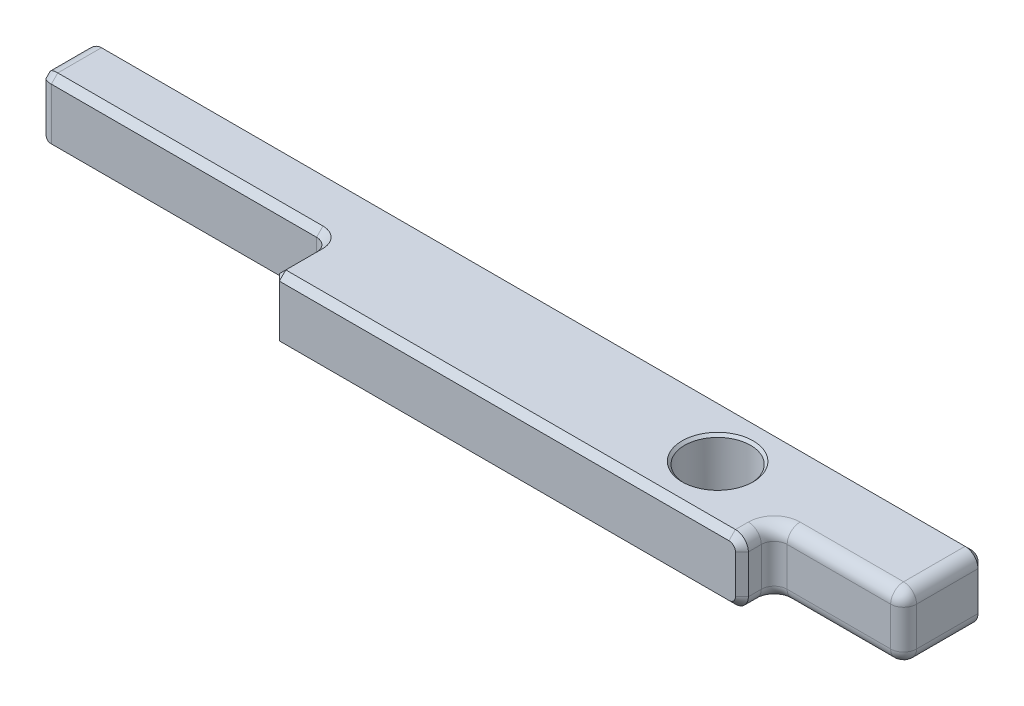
ISO-10303-21;
HEADER;
FILE_DESCRIPTION(('STEP AP214'),'2;1');
FILE_NAME('part.step','',(''),(''),'','','');
FILE_SCHEMA(('AUTOMOTIVE_DESIGN { 1 0 10303 214 1 1 1 1 }'));
ENDSEC;
DATA;
#1=APPLICATION_CONTEXT('core data for automotive mechanical design processes');
#2=APPLICATION_PROTOCOL_DEFINITION('international standard','automotive_design',2000,#1);
#3=PRODUCT_CONTEXT('',#1,'mechanical');
#4=PRODUCT('Part','Part','',(#3));
#5=PRODUCT_RELATED_PRODUCT_CATEGORY('part','',(#4));
#6=PRODUCT_DEFINITION_FORMATION('','',#4);
#7=PRODUCT_DEFINITION_CONTEXT('part definition',#1,'design');
#8=PRODUCT_DEFINITION('design','',#6,#7);
#9=PRODUCT_DEFINITION_SHAPE('','',#8);
#10=(LENGTH_UNIT() NAMED_UNIT(*) SI_UNIT(.MILLI.,.METRE.));
#11=(NAMED_UNIT(*) PLANE_ANGLE_UNIT() SI_UNIT($,.RADIAN.));
#12=(NAMED_UNIT(*) SI_UNIT($,.STERADIAN.) SOLID_ANGLE_UNIT());
#13=UNCERTAINTY_MEASURE_WITH_UNIT(LENGTH_MEASURE(1.E-05),#10,'distance_accuracy_value','');
#14=(GEOMETRIC_REPRESENTATION_CONTEXT(3) GLOBAL_UNCERTAINTY_ASSIGNED_CONTEXT((#13)) GLOBAL_UNIT_ASSIGNED_CONTEXT((#10,
#11,#12)) REPRESENTATION_CONTEXT('',''));
#15=CARTESIAN_POINT('',(0.,0.,0.));
#16=DIRECTION('',(0.,0.,1.));
#17=DIRECTION('',(1.,0.,0.));
#18=AXIS2_PLACEMENT_3D('',#15,#16,#17);
#19=CARTESIAN_POINT('',(41.275,-6.35,11.1125));
#20=DIRECTION('',(-1.,0.,0.));
#21=DIRECTION('',(0.,-1.,0.));
#22=AXIS2_PLACEMENT_3D('',#19,#20,#21);
#23=PLANE('',#22);
#24=DIRECTION('',(0.,0.,-1.));
#25=VECTOR('',#24,1.);
#26=CARTESIAN_POINT('',(41.275,-3.81,11.1125));
#27=LINE('',#26,#25);
#28=CARTESIAN_POINT('',(41.275,-3.81,2.2225));
#29=VERTEX_POINT('',#28);
#30=CARTESIAN_POINT('',(41.275,-3.81,-9.84250000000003));
#31=VERTEX_POINT('',#30);
#32=EDGE_CURVE('E330',#29,#31,#27,.T.);
#33=ORIENTED_EDGE('',*,*,#32,.T.);
#34=DIRECTION('',(0.,1.,0.));
#35=VECTOR('',#34,1.);
#36=CARTESIAN_POINT('',(41.275,3.81,-9.84250000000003));
#37=LINE('',#36,#35);
#38=CARTESIAN_POINT('',(41.275,3.81,-9.84250000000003));
#39=VERTEX_POINT('',#38);
#40=EDGE_CURVE('E833',#31,#39,#37,.T.);
#41=ORIENTED_EDGE('',*,*,#40,.T.);
#42=DIRECTION('',(0.,0.,-1.));
#43=VECTOR('',#42,1.);
#44=CARTESIAN_POINT('',(41.275,3.81,11.1125));
#45=LINE('',#44,#43);
#46=CARTESIAN_POINT('',(41.275,3.81,2.2225));
#47=VERTEX_POINT('',#46);
#48=EDGE_CURVE('E333',#39,#47,#45,.F.);
#49=ORIENTED_EDGE('',*,*,#48,.T.);
#50=DIRECTION('',(0.,1.,0.));
#51=VECTOR('',#50,1.);
#52=CARTESIAN_POINT('',(41.275,-6.35,2.2225));
#53=LINE('',#52,#51);
#54=EDGE_CURVE('E328',#47,#29,#53,.F.);
#55=ORIENTED_EDGE('',*,*,#54,.T.);
#56=EDGE_LOOP('',(#33,#41,#49,#55));
#57=FACE_BOUND('',#56,.T.);
#58=ADVANCED_FACE('F35',(#57),#23,.F.);
#59=CARTESIAN_POINT('',(-133.35,-6.35,11.1125));
#60=DIRECTION('',(1.,0.,0.));
#61=DIRECTION('',(0.,0.,-1.));
#62=AXIS2_PLACEMENT_3D('',#59,#60,#61);
#63=PLANE('',#62);
#64=DIRECTION('',(0.,0.,-1.));
#65=VECTOR('',#64,1.);
#66=CARTESIAN_POINT('',(-133.35,-3.81,11.1125));
#67=LINE('',#66,#65);
#68=CARTESIAN_POINT('',(-133.35,-3.81,-8.5725));
#69=VERTEX_POINT('',#68);
#70=CARTESIAN_POINT('',(-133.35,-3.81,-2.54));
#71=VERTEX_POINT('',#70);
#72=EDGE_CURVE('E271',#69,#71,#67,.F.);
#73=ORIENTED_EDGE('',*,*,#72,.T.);
#74=DIRECTION('',(0.,1.,0.));
#75=VECTOR('',#74,1.);
#76=CARTESIAN_POINT('',(-133.35,-6.35,-2.54));
#77=LINE('',#76,#75);
#78=CARTESIAN_POINT('',(-133.35,3.81,-2.54));
#79=VERTEX_POINT('',#78);
#80=EDGE_CURVE('E248',#71,#79,#77,.T.);
#81=ORIENTED_EDGE('',*,*,#80,.T.);
#82=DIRECTION('',(0.,0.,-1.));
#83=VECTOR('',#82,1.);
#84=CARTESIAN_POINT('',(-133.35,3.81,11.1125));
#85=LINE('',#84,#83);
#86=CARTESIAN_POINT('',(-133.35,3.81,-8.5725));
#87=VERTEX_POINT('',#86);
#88=EDGE_CURVE('E258',#79,#87,#85,.T.);
#89=ORIENTED_EDGE('',*,*,#88,.T.);
#90=DIRECTION('',(0.,-1.,0.));
#91=VECTOR('',#90,1.);
#92=CARTESIAN_POINT('',(-133.35,-6.35,-8.5725));
#93=LINE('',#92,#91);
#94=EDGE_CURVE('E265',#87,#69,#93,.T.);
#95=ORIENTED_EDGE('',*,*,#94,.T.);
#96=EDGE_LOOP('',(#73,#81,#89,#95));
#97=FACE_BOUND('',#96,.T.);
#98=ADVANCED_FACE('F269',(#97),#63,.F.);
#99=CARTESIAN_POINT('',(-133.35,-6.35,11.1125));
#100=DIRECTION('',(0.,1.,0.));
#101=DIRECTION('',(0.,0.,1.));
#102=AXIS2_PLACEMENT_3D('',#99,#100,#101);
#103=PLANE('',#102);
#104=CARTESIAN_POINT('',(0.,-6.35,0.));
#105=DIRECTION('',(0.,1.,0.));
#106=DIRECTION('',(0.,0.,1.));
#107=AXIS2_PLACEMENT_3D('',#104,#105,#106);
#108=CIRCLE('',#107,6.98500000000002);
#109=CARTESIAN_POINT('',(0.,-6.35,6.98500000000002));
#110=VERTEX_POINT('',#109);
#111=EDGE_CURVE('E382',#110,#110,#108,.T.);
#112=ORIENTED_EDGE('',*,*,#111,.T.);
#113=EDGE_LOOP('',(#112));
#114=FACE_BOUND('',#113,.T.);
#115=DIRECTION('',(0.,0.,-1.));
#116=VECTOR('',#115,1.);
#117=CARTESIAN_POINT('',(-130.81,-6.35,11.1125));
#118=LINE('',#117,#116);
#119=CARTESIAN_POINT('',(-130.81,-6.35,-1.26999999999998));
#120=VERTEX_POINT('',#119);
#121=CARTESIAN_POINT('',(-130.81,-6.35,-9.84250000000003));
#122=VERTEX_POINT('',#121);
#123=EDGE_CURVE('E887',#120,#122,#118,.T.);
#124=ORIENTED_EDGE('',*,*,#123,.T.);
#125=DIRECTION('',(1.,0.,0.));
#126=VECTOR('',#125,1.);
#127=CARTESIAN_POINT('',(38.735,-6.35,-9.84250000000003));
#128=LINE('',#127,#126);
#129=CARTESIAN_POINT('',(38.735,-6.35,-9.84250000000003));
#130=VERTEX_POINT('',#129);
#131=EDGE_CURVE('E419',#122,#130,#128,.T.);
#132=ORIENTED_EDGE('',*,*,#131,.T.);
#133=DIRECTION('',(0.,0.,-1.));
#134=VECTOR('',#133,1.);
#135=CARTESIAN_POINT('',(38.735,-6.35,11.1125));
#136=LINE('',#135,#134);
#137=CARTESIAN_POINT('',(38.735,-6.35,2.2225));
#138=VERTEX_POINT('',#137);
#139=EDGE_CURVE('E966',#130,#138,#136,.F.);
#140=ORIENTED_EDGE('',*,*,#139,.T.);
#141=DIRECTION('',(1.,0.,0.));
#142=VECTOR('',#141,1.);
#143=CARTESIAN_POINT('',(15.875,-6.35,2.2225));
#144=LINE('',#143,#142);
#145=CARTESIAN_POINT('',(18.415,-6.35,2.2225));
#146=VERTEX_POINT('',#145);
#147=EDGE_CURVE('E970',#138,#146,#144,.F.);
#148=ORIENTED_EDGE('',*,*,#147,.T.);
#149=CARTESIAN_POINT('',(18.415,-6.35,7.3025));
#150=DIRECTION('',(0.,1.,0.));
#151=DIRECTION('',(0.,0.,1.));
#152=AXIS2_PLACEMENT_3D('',#149,#150,#151);
#153=CIRCLE('',#152,5.08);
#154=CARTESIAN_POINT('',(13.335,-6.35,7.3025));
#155=VERTEX_POINT('',#154);
#156=EDGE_CURVE('E401',#155,#146,#153,.F.);
#157=ORIENTED_EDGE('',*,*,#156,.F.);
#158=DIRECTION('',(0.,0.,1.));
#159=VECTOR('',#158,1.);
#160=CARTESIAN_POINT('',(13.335,-6.35,11.1125));
#161=LINE('',#160,#159);
#162=CARTESIAN_POINT('',(13.335,-6.35,9.84250000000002));
#163=VERTEX_POINT('',#162);
#164=EDGE_CURVE('E891',#155,#163,#161,.T.);
#165=ORIENTED_EDGE('',*,*,#164,.T.);
#166=DIRECTION('',(-1.,0.,0.));
#167=VECTOR('',#166,1.);
#168=CARTESIAN_POINT('',(-133.35,-6.35,9.84250000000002));
#169=LINE('',#168,#167);
#170=CARTESIAN_POINT('',(-74.93,-6.35,9.84250000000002));
#171=VERTEX_POINT('',#170);
#172=EDGE_CURVE('E818',#163,#171,#169,.T.);
#173=ORIENTED_EDGE('',*,*,#172,.T.);
#174=DIRECTION('',(0.,0.,-1.));
#175=VECTOR('',#174,1.);
#176=CARTESIAN_POINT('',(-74.93,-6.35,11.1125));
#177=LINE('',#176,#175);
#178=CARTESIAN_POINT('',(-74.93,-6.35,2.54));
#179=VERTEX_POINT('',#178);
#180=EDGE_CURVE('E821',#171,#179,#177,.T.);
#181=ORIENTED_EDGE('',*,*,#180,.T.);
#182=CARTESIAN_POINT('',(-78.74,-6.35,2.54));
#183=DIRECTION('',(0.,1.,0.));
#184=DIRECTION('',(0.,0.,1.));
#185=AXIS2_PLACEMENT_3D('',#182,#183,#184);
#186=CIRCLE('',#185,3.80999999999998);
#187=CARTESIAN_POINT('',(-78.74,-6.35,-1.26999999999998));
#188=VERTEX_POINT('',#187);
#189=EDGE_CURVE('E823',#179,#188,#186,.T.);
#190=ORIENTED_EDGE('',*,*,#189,.T.);
#191=DIRECTION('',(-1.,0.,0.));
#192=VECTOR('',#191,1.);
#193=CARTESIAN_POINT('',(-133.35,-6.35,-1.26999999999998));
#194=LINE('',#193,#192);
#195=EDGE_CURVE('E827',#188,#120,#194,.T.);
#196=ORIENTED_EDGE('',*,*,#195,.T.);
#197=EDGE_LOOP('',(#124,#132,#140,#148,#157,#165,#173,#181,#190,#196));
#198=FACE_BOUND('',#197,.T.);
#199=ADVANCED_FACE('F740',(#114,#198),#103,.F.);
#200=CARTESIAN_POINT('',(-133.35,6.35,11.1125));
#201=DIRECTION('',(0.,-1.,0.));
#202=DIRECTION('',(0.,0.,-1.));
#203=AXIS2_PLACEMENT_3D('',#200,#201,#202);
#204=PLANE('',#203);
#205=DIRECTION('',(0.,0.,-1.));
#206=VECTOR('',#205,1.);
#207=CARTESIAN_POINT('',(38.735,6.35,11.1125));
#208=LINE('',#207,#206);
#209=CARTESIAN_POINT('',(38.735,6.35,2.2225));
#210=VERTEX_POINT('',#209);
#211=CARTESIAN_POINT('',(38.735,6.35,-9.84250000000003));
#212=VERTEX_POINT('',#211);
#213=EDGE_CURVE('E984',#210,#212,#208,.T.);
#214=ORIENTED_EDGE('',*,*,#213,.T.);
#215=DIRECTION('',(-1.,0.,0.));
#216=VECTOR('',#215,1.);
#217=CARTESIAN_POINT('',(-130.81,6.35,-9.84250000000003));
#218=LINE('',#217,#216);
#219=CARTESIAN_POINT('',(-130.81,6.35,-9.84250000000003));
#220=VERTEX_POINT('',#219);
#221=EDGE_CURVE('E851',#212,#220,#218,.T.);
#222=ORIENTED_EDGE('',*,*,#221,.T.);
#223=DIRECTION('',(0.,0.,-1.));
#224=VECTOR('',#223,1.);
#225=CARTESIAN_POINT('',(-130.81,6.35,11.1125));
#226=LINE('',#225,#224);
#227=CARTESIAN_POINT('',(-130.81,6.35,-1.26999999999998));
#228=VERTEX_POINT('',#227);
#229=EDGE_CURVE('E311',#220,#228,#226,.F.);
#230=ORIENTED_EDGE('',*,*,#229,.T.);
#231=DIRECTION('',(1.,0.,0.));
#232=VECTOR('',#231,1.);
#233=CARTESIAN_POINT('',(-133.35,6.35,-1.26999999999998));
#234=LINE('',#233,#232);
#235=CARTESIAN_POINT('',(-78.74,6.35,-1.26999999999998));
#236=VERTEX_POINT('',#235);
#237=EDGE_CURVE('E857',#228,#236,#234,.T.);
#238=ORIENTED_EDGE('',*,*,#237,.T.);
#239=CARTESIAN_POINT('',(-78.74,6.35,2.54));
#240=DIRECTION('',(0.,-1.,0.));
#241=DIRECTION('',(0.,0.,-1.));
#242=AXIS2_PLACEMENT_3D('',#239,#240,#241);
#243=CIRCLE('',#242,3.80999999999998);
#244=CARTESIAN_POINT('',(-74.93,6.35,2.54));
#245=VERTEX_POINT('',#244);
#246=EDGE_CURVE('E861',#236,#245,#243,.T.);
#247=ORIENTED_EDGE('',*,*,#246,.T.);
#248=DIRECTION('',(0.,0.,1.));
#249=VECTOR('',#248,1.);
#250=CARTESIAN_POINT('',(-74.93,6.35,11.1125));
#251=LINE('',#250,#249);
#252=CARTESIAN_POINT('',(-74.93,6.35,9.84250000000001));
#253=VERTEX_POINT('',#252);
#254=EDGE_CURVE('E863',#245,#253,#251,.T.);
#255=ORIENTED_EDGE('',*,*,#254,.T.);
#256=DIRECTION('',(1.,0.,0.));
#257=VECTOR('',#256,1.);
#258=CARTESIAN_POINT('',(-133.35,6.35,9.84250000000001));
#259=LINE('',#258,#257);
#260=CARTESIAN_POINT('',(13.335,6.35,9.84250000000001));
#261=VERTEX_POINT('',#260);
#262=EDGE_CURVE('E855',#253,#261,#259,.T.);
#263=ORIENTED_EDGE('',*,*,#262,.T.);
#264=DIRECTION('',(0.,0.,-1.));
#265=VECTOR('',#264,1.);
#266=CARTESIAN_POINT('',(13.335,6.35,11.1125));
#267=LINE('',#266,#265);
#268=CARTESIAN_POINT('',(13.335,6.35,7.3025));
#269=VERTEX_POINT('',#268);
#270=EDGE_CURVE('E315',#261,#269,#267,.T.);
#271=ORIENTED_EDGE('',*,*,#270,.T.);
#272=CARTESIAN_POINT('',(18.415,6.35,7.3025));
#273=DIRECTION('',(0.,-1.,0.));
#274=DIRECTION('',(0.,0.,-1.));
#275=AXIS2_PLACEMENT_3D('',#272,#273,#274);
#276=CIRCLE('',#275,5.08);
#277=CARTESIAN_POINT('',(18.415,6.35,2.2225));
#278=VERTEX_POINT('',#277);
#279=EDGE_CURVE('E1331',#278,#269,#276,.F.);
#280=ORIENTED_EDGE('',*,*,#279,.F.);
#281=DIRECTION('',(-1.,0.,0.));
#282=VECTOR('',#281,1.);
#283=CARTESIAN_POINT('',(41.275,6.35,2.2225));
#284=LINE('',#283,#282);
#285=EDGE_CURVE('E901',#278,#210,#284,.F.);
#286=ORIENTED_EDGE('',*,*,#285,.T.);
#287=EDGE_LOOP('',(#214,#222,#230,#238,#247,#255,#263,#271,#280,#286));
#288=FACE_BOUND('',#287,.T.);
#289=CARTESIAN_POINT('',(0.,6.35,0.));
#290=DIRECTION('',(0.,-1.,0.));
#291=DIRECTION('',(0.,0.,-1.));
#292=AXIS2_PLACEMENT_3D('',#289,#290,#291);
#293=CIRCLE('',#292,6.98500000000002);
#294=CARTESIAN_POINT('',(0.,6.35,-6.98500000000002));
#295=VERTEX_POINT('',#294);
#296=EDGE_CURVE('E266',#295,#295,#293,.T.);
#297=ORIENTED_EDGE('',*,*,#296,.T.);
#298=EDGE_LOOP('',(#297));
#299=FACE_BOUND('',#298,.T.);
#300=ADVANCED_FACE('F744',(#288,#299),#204,.F.);
#301=CARTESIAN_POINT('',(-133.35,6.35,11.1125));
#302=DIRECTION('',(0.,0.,-1.));
#303=DIRECTION('',(-1.,0.,0.));
#304=AXIS2_PLACEMENT_3D('',#301,#302,#303);
#305=PLANE('',#304);
#306=DIRECTION('',(0.,1.,0.));
#307=VECTOR('',#306,1.);
#308=CARTESIAN_POINT('',(14.605,6.35000000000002,11.1125));
#309=LINE('',#308,#307);
#310=CARTESIAN_POINT('',(14.605,-3.81,11.1125));
#311=VERTEX_POINT('',#310);
#312=CARTESIAN_POINT('',(14.605,3.81,11.1125));
#313=VERTEX_POINT('',#312);
#314=EDGE_CURVE('E789',#311,#313,#309,.T.);
#315=ORIENTED_EDGE('',*,*,#314,.T.);
#316=CARTESIAN_POINT('',(13.335,3.81,11.1125));
#317=DIRECTION('',(0.,0.,-1.));
#318=DIRECTION('',(-1.,0.,0.));
#319=AXIS2_PLACEMENT_3D('',#316,#317,#318);
#320=CIRCLE('',#319,1.27000000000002);
#321=CARTESIAN_POINT('',(13.335,5.08000000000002,11.1125));
#322=VERTEX_POINT('',#321);
#323=EDGE_CURVE('E792',#313,#322,#320,.F.);
#324=ORIENTED_EDGE('',*,*,#323,.T.);
#325=DIRECTION('',(-1.,0.,0.));
#326=VECTOR('',#325,1.);
#327=CARTESIAN_POINT('',(-133.35,5.08000000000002,11.1125));
#328=LINE('',#327,#326);
#329=CARTESIAN_POINT('',(-74.93,5.08000000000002,11.1125));
#330=VERTEX_POINT('',#329);
#331=EDGE_CURVE('E1340',#322,#330,#328,.T.);
#332=ORIENTED_EDGE('',*,*,#331,.T.);
#333=DIRECTION('',(0.,-1.,0.));
#334=VECTOR('',#333,1.);
#335=CARTESIAN_POINT('',(-74.93,6.35,11.1125));
#336=LINE('',#335,#334);
#337=CARTESIAN_POINT('',(-74.93,-5.08000000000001,11.1125));
#338=VERTEX_POINT('',#337);
#339=EDGE_CURVE('E252',#330,#338,#336,.T.);
#340=ORIENTED_EDGE('',*,*,#339,.T.);
#341=DIRECTION('',(1.,0.,0.));
#342=VECTOR('',#341,1.);
#343=CARTESIAN_POINT('',(-133.35,-5.08000000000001,11.1125));
#344=LINE('',#343,#342);
#345=CARTESIAN_POINT('',(13.335,-5.08000000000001,11.1125));
#346=VERTEX_POINT('',#345);
#347=EDGE_CURVE('E1342',#338,#346,#344,.T.);
#348=ORIENTED_EDGE('',*,*,#347,.T.);
#349=CARTESIAN_POINT('',(13.335,-3.81,11.1125));
#350=DIRECTION('',(0.,0.,-1.));
#351=DIRECTION('',(-1.,0.,0.));
#352=AXIS2_PLACEMENT_3D('',#349,#350,#351);
#353=CIRCLE('',#352,1.27000000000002);
#354=EDGE_CURVE('E794',#346,#311,#353,.F.);
#355=ORIENTED_EDGE('',*,*,#354,.T.);
#356=EDGE_LOOP('',(#315,#324,#332,#340,#348,#355));
#357=FACE_BOUND('',#356,.T.);
#358=ADVANCED_FACE('F777',(#357),#305,.F.);
#359=CARTESIAN_POINT('',(-133.35,6.35,-11.1125));
#360=DIRECTION('',(0.,0.,-1.));
#361=DIRECTION('',(-1.,0.,0.));
#362=AXIS2_PLACEMENT_3D('',#359,#360,#361);
#363=PLANE('',#362);
#364=DIRECTION('',(0.,-1.,0.));
#365=VECTOR('',#364,1.);
#366=CARTESIAN_POINT('',(-130.81,6.35,-11.1125));
#367=LINE('',#366,#365);
#368=CARTESIAN_POINT('',(-130.81,-5.08000000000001,-11.1125));
#369=VERTEX_POINT('',#368);
#370=CARTESIAN_POINT('',(-130.81,5.08000000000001,-11.1125));
#371=VERTEX_POINT('',#370);
#372=EDGE_CURVE('E890',#369,#371,#367,.F.);
#373=ORIENTED_EDGE('',*,*,#372,.T.);
#374=DIRECTION('',(1.,0.,0.));
#375=VECTOR('',#374,1.);
#376=CARTESIAN_POINT('',(38.735,5.08000000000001,-11.1125));
#377=LINE('',#376,#375);
#378=CARTESIAN_POINT('',(38.735,5.08000000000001,-11.1125));
#379=VERTEX_POINT('',#378);
#380=EDGE_CURVE('E837',#371,#379,#377,.T.);
#381=ORIENTED_EDGE('',*,*,#380,.T.);
#382=CARTESIAN_POINT('',(38.735,3.81,-11.1125));
#383=DIRECTION('',(0.,0.,-1.));
#384=DIRECTION('',(-1.,0.,0.));
#385=AXIS2_PLACEMENT_3D('',#382,#383,#384);
#386=CIRCLE('',#385,1.27000000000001);
#387=CARTESIAN_POINT('',(40.005,3.81,-11.1125));
#388=VERTEX_POINT('',#387);
#389=EDGE_CURVE('E841',#379,#388,#386,.T.);
#390=ORIENTED_EDGE('',*,*,#389,.T.);
#391=DIRECTION('',(0.,-1.,0.));
#392=VECTOR('',#391,1.);
#393=CARTESIAN_POINT('',(40.005,-3.81,-11.1125));
#394=LINE('',#393,#392);
#395=CARTESIAN_POINT('',(40.005,-3.81,-11.1125));
#396=VERTEX_POINT('',#395);
#397=EDGE_CURVE('E843',#388,#396,#394,.T.);
#398=ORIENTED_EDGE('',*,*,#397,.T.);
#399=CARTESIAN_POINT('',(38.735,-3.81,-11.1125));
#400=DIRECTION('',(0.,0.,-1.));
#401=DIRECTION('',(-1.,0.,0.));
#402=AXIS2_PLACEMENT_3D('',#399,#400,#401);
#403=CIRCLE('',#402,1.27000000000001);
#404=CARTESIAN_POINT('',(38.735,-5.08000000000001,-11.1125));
#405=VERTEX_POINT('',#404);
#406=EDGE_CURVE('E845',#396,#405,#403,.T.);
#407=ORIENTED_EDGE('',*,*,#406,.T.);
#408=DIRECTION('',(-1.,0.,0.));
#409=VECTOR('',#408,1.);
#410=CARTESIAN_POINT('',(-130.81,-5.08000000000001,-11.1125));
#411=LINE('',#410,#409);
#412=EDGE_CURVE('E847',#405,#369,#411,.T.);
#413=ORIENTED_EDGE('',*,*,#412,.T.);
#414=EDGE_LOOP('',(#373,#381,#390,#398,#407,#413));
#415=FACE_BOUND('',#414,.T.);
#416=ADVANCED_FACE('F767',(#415),#363,.T.);
#417=CARTESIAN_POINT('',(0.,-6.35,0.));
#418=DIRECTION('',(0.,1.,0.));
#419=DIRECTION('',(0.,0.,1.));
#420=AXIS2_PLACEMENT_3D('',#417,#418,#419);
#421=CYLINDRICAL_SURFACE('',#420,6.477);
#422=CARTESIAN_POINT('',(0.,-5.842,0.));
#423=DIRECTION('',(0.,1.,0.));
#424=DIRECTION('',(0.,0.,1.));
#425=AXIS2_PLACEMENT_3D('',#422,#423,#424);
#426=CIRCLE('',#425,6.477);
#427=CARTESIAN_POINT('',(0.,-5.842,6.477));
#428=VERTEX_POINT('',#427);
#429=EDGE_CURVE('E392',#428,#428,#426,.F.);
#430=ORIENTED_EDGE('',*,*,#429,.T.);
#431=EDGE_LOOP('',(#430));
#432=FACE_BOUND('',#431,.T.);
#433=CARTESIAN_POINT('',(0.,5.842,0.));
#434=DIRECTION('',(0.,-1.,0.));
#435=DIRECTION('',(0.,0.,-1.));
#436=AXIS2_PLACEMENT_3D('',#433,#434,#435);
#437=CIRCLE('',#436,6.477);
#438=CARTESIAN_POINT('',(0.,5.842,-6.477));
#439=VERTEX_POINT('',#438);
#440=EDGE_CURVE('E387',#439,#439,#437,.F.);
#441=ORIENTED_EDGE('',*,*,#440,.T.);
#442=EDGE_LOOP('',(#441));
#443=FACE_BOUND('',#442,.T.);
#444=ADVANCED_FACE('F764',(#432,#443),#421,.F.);
#445=CARTESIAN_POINT('',(15.875,-14.3521023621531,4.7625));
#446=DIRECTION('',(0.,0.,1.));
#447=DIRECTION('',(1.,0.,0.));
#448=AXIS2_PLACEMENT_3D('',#445,#446,#447);
#449=PLANE('',#448);
#450=DIRECTION('',(1.,0.,0.));
#451=VECTOR('',#450,1.);
#452=CARTESIAN_POINT('',(41.275,-3.81,4.7625));
#453=LINE('',#452,#451);
#454=CARTESIAN_POINT('',(18.415,-3.81,4.7625));
#455=VERTEX_POINT('',#454);
#456=CARTESIAN_POINT('',(38.735,-3.81,4.7625));
#457=VERTEX_POINT('',#456);
#458=EDGE_CURVE('E337',#455,#457,#453,.T.);
#459=ORIENTED_EDGE('',*,*,#458,.T.);
#460=DIRECTION('',(0.,1.,0.));
#461=VECTOR('',#460,1.);
#462=CARTESIAN_POINT('',(38.735,6.35,4.7625));
#463=LINE('',#462,#461);
#464=CARTESIAN_POINT('',(38.735,3.81,4.7625));
#465=VERTEX_POINT('',#464);
#466=EDGE_CURVE('E341',#457,#465,#463,.T.);
#467=ORIENTED_EDGE('',*,*,#466,.T.);
#468=DIRECTION('',(-1.,0.,0.));
#469=VECTOR('',#468,1.);
#470=CARTESIAN_POINT('',(15.875,3.81,4.7625));
#471=LINE('',#470,#469);
#472=CARTESIAN_POINT('',(18.415,3.81,4.7625));
#473=VERTEX_POINT('',#472);
#474=EDGE_CURVE('E339',#465,#473,#471,.T.);
#475=ORIENTED_EDGE('',*,*,#474,.T.);
#476=DIRECTION('',(0.,-1.,0.));
#477=VECTOR('',#476,1.);
#478=CARTESIAN_POINT('',(18.415,-14.3521023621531,4.7625));
#479=LINE('',#478,#477);
#480=EDGE_CURVE('E335',#473,#455,#479,.T.);
#481=ORIENTED_EDGE('',*,*,#480,.T.);
#482=EDGE_LOOP('',(#459,#467,#475,#481));
#483=FACE_BOUND('',#482,.T.);
#484=ADVANCED_FACE('F766',(#483),#449,.T.);
#485=CARTESIAN_POINT('',(15.875,14.517153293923,4.7625));
#486=DIRECTION('',(-1.,0.,0.));
#487=DIRECTION('',(0.,-1.,0.));
#488=AXIS2_PLACEMENT_3D('',#485,#486,#487);
#489=PLANE('',#488);
#490=DIRECTION('',(0.,0.,-1.));
#491=VECTOR('',#490,1.);
#492=CARTESIAN_POINT('',(15.875,3.81,4.7625));
#493=LINE('',#492,#491);
#494=CARTESIAN_POINT('',(15.875,3.81,7.3025));
#495=VERTEX_POINT('',#494);
#496=CARTESIAN_POINT('',(15.875,3.81,9.84250000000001));
#497=VERTEX_POINT('',#496);
#498=EDGE_CURVE('E325',#495,#497,#493,.F.);
#499=ORIENTED_EDGE('',*,*,#498,.T.);
#500=DIRECTION('',(0.,-1.,0.));
#501=VECTOR('',#500,1.);
#502=CARTESIAN_POINT('',(15.875,14.517153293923,9.84250000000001));
#503=LINE('',#502,#501);
#504=CARTESIAN_POINT('',(15.875,-3.81,9.84250000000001));
#505=VERTEX_POINT('',#504);
#506=EDGE_CURVE('E446',#497,#505,#503,.T.);
#507=ORIENTED_EDGE('',*,*,#506,.T.);
#508=DIRECTION('',(0.,0.,1.));
#509=VECTOR('',#508,1.);
#510=CARTESIAN_POINT('',(15.875,-3.81,4.7625));
#511=LINE('',#510,#509);
#512=CARTESIAN_POINT('',(15.875,-3.81,7.3025));
#513=VERTEX_POINT('',#512);
#514=EDGE_CURVE('E323',#505,#513,#511,.F.);
#515=ORIENTED_EDGE('',*,*,#514,.T.);
#516=DIRECTION('',(0.,-1.,0.));
#517=VECTOR('',#516,1.);
#518=CARTESIAN_POINT('',(15.875,14.517153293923,7.3025));
#519=LINE('',#518,#517);
#520=EDGE_CURVE('E314',#513,#495,#519,.F.);
#521=ORIENTED_EDGE('',*,*,#520,.T.);
#522=EDGE_LOOP('',(#499,#507,#515,#521));
#523=FACE_BOUND('',#522,.T.);
#524=ADVANCED_FACE('F774',(#523),#489,.F.);
#525=CARTESIAN_POINT('',(-152.4,12.7,0.));
#526=DIRECTION('',(0.,0.,-1.));
#527=DIRECTION('',(-1.,0.,0.));
#528=AXIS2_PLACEMENT_3D('',#525,#526,#527);
#529=PLANE('',#528);
#530=DIRECTION('',(0.,1.,0.));
#531=VECTOR('',#530,1.);
#532=CARTESIAN_POINT('',(-78.74,6.35,0.));
#533=LINE('',#532,#531);
#534=CARTESIAN_POINT('',(-78.74,-5.08,0.));
#535=VERTEX_POINT('',#534);
#536=CARTESIAN_POINT('',(-78.74,5.08000000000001,0.));
#537=VERTEX_POINT('',#536);
#538=EDGE_CURVE('E272',#535,#537,#533,.T.);
#539=ORIENTED_EDGE('',*,*,#538,.T.);
#540=DIRECTION('',(-1.,0.,0.));
#541=VECTOR('',#540,1.);
#542=CARTESIAN_POINT('',(-152.4,5.08000000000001,0.));
#543=LINE('',#542,#541);
#544=CARTESIAN_POINT('',(-130.81,5.08000000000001,0.));
#545=VERTEX_POINT('',#544);
#546=EDGE_CURVE('E426',#537,#545,#543,.T.);
#547=ORIENTED_EDGE('',*,*,#546,.T.);
#548=DIRECTION('',(0.,1.,0.));
#549=VECTOR('',#548,1.);
#550=CARTESIAN_POINT('',(-130.81,12.7,0.));
#551=LINE('',#550,#549);
#552=CARTESIAN_POINT('',(-130.81,-5.08,0.));
#553=VERTEX_POINT('',#552);
#554=EDGE_CURVE('E251',#545,#553,#551,.F.);
#555=ORIENTED_EDGE('',*,*,#554,.T.);
#556=DIRECTION('',(1.,0.,0.));
#557=VECTOR('',#556,1.);
#558=CARTESIAN_POINT('',(-152.4,-5.08,0.));
#559=LINE('',#558,#557);
#560=EDGE_CURVE('E423',#553,#535,#559,.T.);
#561=ORIENTED_EDGE('',*,*,#560,.T.);
#562=EDGE_LOOP('',(#539,#547,#555,#561));
#563=FACE_BOUND('',#562,.T.);
#564=ADVANCED_FACE('F421',(#563),#529,.F.);
#565=CARTESIAN_POINT('',(-76.2,-12.7,0.));
#566=DIRECTION('',(1.,0.,0.));
#567=DIRECTION('',(0.,0.,-1.));
#568=AXIS2_PLACEMENT_3D('',#565,#566,#567);
#569=PLANE('',#568);
#570=DIRECTION('',(0.,1.,0.));
#571=VECTOR('',#570,1.);
#572=CARTESIAN_POINT('',(-76.2,-12.7,9.84250000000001));
#573=LINE('',#572,#571);
#574=CARTESIAN_POINT('',(-76.2,-5.08000000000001,9.84250000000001));
#575=VERTEX_POINT('',#574);
#576=CARTESIAN_POINT('',(-76.2,5.08,9.84250000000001));
#577=VERTEX_POINT('',#576);
#578=EDGE_CURVE('E48',#575,#577,#573,.T.);
#579=ORIENTED_EDGE('',*,*,#578,.T.);
#580=DIRECTION('',(0.,0.,-1.));
#581=VECTOR('',#580,1.);
#582=CARTESIAN_POINT('',(-76.2,5.08,0.));
#583=LINE('',#582,#581);
#584=CARTESIAN_POINT('',(-76.2,5.08,2.54));
#585=VERTEX_POINT('',#584);
#586=EDGE_CURVE('E11',#577,#585,#583,.T.);
#587=ORIENTED_EDGE('',*,*,#586,.T.);
#588=DIRECTION('',(0.,1.,0.));
#589=VECTOR('',#588,1.);
#590=CARTESIAN_POINT('',(-76.2,-6.35,2.54));
#591=LINE('',#590,#589);
#592=CARTESIAN_POINT('',(-76.2,-5.08,2.54));
#593=VERTEX_POINT('',#592);
#594=EDGE_CURVE('E239',#585,#593,#591,.F.);
#595=ORIENTED_EDGE('',*,*,#594,.T.);
#596=DIRECTION('',(0.,0.,1.));
#597=VECTOR('',#596,1.);
#598=CARTESIAN_POINT('',(-76.2,-5.08000000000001,0.));
#599=LINE('',#598,#597);
#600=EDGE_CURVE('E59',#593,#575,#599,.T.);
#601=ORIENTED_EDGE('',*,*,#600,.T.);
#602=EDGE_LOOP('',(#579,#587,#595,#601));
#603=FACE_BOUND('',#602,.T.);
#604=ADVANCED_FACE('F751',(#603),#569,.F.);
#605=CARTESIAN_POINT('',(0.,-6.35,0.));
#606=DIRECTION('',(0.,-1.,0.));
#607=DIRECTION('',(0.,0.,-1.));
#608=AXIS2_PLACEMENT_3D('',#605,#606,#607);
#609=CONICAL_SURFACE('',#608,6.98500000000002,0.78539816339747);
#610=ORIENTED_EDGE('',*,*,#429,.F.);
#611=EDGE_LOOP('',(#610));
#612=FACE_BOUND('',#611,.T.);
#613=ORIENTED_EDGE('',*,*,#111,.F.);
#614=EDGE_LOOP('',(#613));
#615=FACE_BOUND('',#614,.T.);
#616=ADVANCED_FACE('F748',(#612,#615),#609,.F.);
#617=CARTESIAN_POINT('',(0.,5.842,0.));
#618=DIRECTION('',(0.,1.,0.));
#619=DIRECTION('',(0.,0.,1.));
#620=AXIS2_PLACEMENT_3D('',#617,#618,#619);
#621=CONICAL_SURFACE('',#620,6.477,0.785398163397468);
#622=ORIENTED_EDGE('',*,*,#296,.F.);
#623=EDGE_LOOP('',(#622));
#624=FACE_BOUND('',#623,.T.);
#625=ORIENTED_EDGE('',*,*,#440,.F.);
#626=EDGE_LOOP('',(#625));
#627=FACE_BOUND('',#626,.T.);
#628=ADVANCED_FACE('F750',(#624,#627),#621,.F.);
#629=CARTESIAN_POINT('',(-130.81,-6.35,-8.5725));
#630=DIRECTION('',(0.,1.,0.));
#631=DIRECTION('',(0.,0.,1.));
#632=AXIS2_PLACEMENT_3D('',#629,#630,#631);
#633=CYLINDRICAL_SURFACE('',#632,2.54);
#634=ORIENTED_EDGE('',*,*,#94,.F.);
#635=CARTESIAN_POINT('',(-130.81,5.08000000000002,-11.1125));
#636=CARTESIAN_POINT('',(-132.167238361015,5.09753017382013,-11.1475603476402));
#637=CARTESIAN_POINT('',(-133.38506034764,4.48861918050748,-9.92973836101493));
#638=CARTESIAN_POINT('',(-133.35,3.81,-8.5725));
#639=B_SPLINE_CURVE_WITH_KNOTS('',3,(#635,#636,#637,#638),.UNSPECIFIED.,.F.,.F.,(4,4),
(-1.5707963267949,0.),.UNSPECIFIED.);
#640=EDGE_CURVE('E525',#87,#371,#639,.F.);
#641=ORIENTED_EDGE('',*,*,#640,.T.);
#642=ORIENTED_EDGE('',*,*,#372,.F.);
#643=CARTESIAN_POINT('',(-133.35,-3.81,-8.5725));
#644=CARTESIAN_POINT('',(-133.38506034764,-4.48861918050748,-9.92973836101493));
#645=CARTESIAN_POINT('',(-132.167238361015,-5.09753017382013,-11.1475603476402));
#646=CARTESIAN_POINT('',(-130.81,-5.08000000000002,-11.1125));
#647=B_SPLINE_CURVE_WITH_KNOTS('',3,(#643,#644,#645,#646),.UNSPECIFIED.,.F.,.F.,(4,4),(0.,
1.5707963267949),.UNSPECIFIED.);
#648=EDGE_CURVE('E590',#369,#69,#647,.F.);
#649=ORIENTED_EDGE('',*,*,#648,.T.);
#650=EDGE_LOOP('',(#634,#641,#642,#649));
#651=FACE_BOUND('',#650,.T.);
#652=ADVANCED_FACE('F754',(#651),#633,.T.);
#653=CARTESIAN_POINT('',(-130.81,-3.81,11.1125));
#654=DIRECTION('',(0.,0.,-1.));
#655=DIRECTION('',(-1.,0.,0.));
#656=AXIS2_PLACEMENT_3D('',#653,#654,#655);
#657=CYLINDRICAL_SURFACE('',#656,2.54);
#658=ORIENTED_EDGE('',*,*,#72,.F.);
#659=CARTESIAN_POINT('',(-130.81,-6.35000000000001,-9.84250000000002));
#660=CARTESIAN_POINT('',(-132.167238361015,-6.38506034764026,-9.86003017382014));
#661=CARTESIAN_POINT('',(-133.38506034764,-5.16723836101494,-9.25111918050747));
#662=CARTESIAN_POINT('',(-133.35,-3.81,-8.5725));
#663=B_SPLINE_CURVE_WITH_KNOTS('',3,(#659,#660,#661,#662),.UNSPECIFIED.,.F.,.F.,(4,4),(0.,
1.5707963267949),.UNSPECIFIED.);
#664=EDGE_CURVE('E865',#69,#122,#663,.F.);
#665=ORIENTED_EDGE('',*,*,#664,.T.);
#666=ORIENTED_EDGE('',*,*,#123,.F.);
#667=CARTESIAN_POINT('',(-133.35,-3.81,-2.54));
#668=CARTESIAN_POINT('',(-133.38506034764,-5.16723836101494,-1.86138081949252));
#669=CARTESIAN_POINT('',(-132.167238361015,-6.38506034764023,-1.25246982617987));
#670=CARTESIAN_POINT('',(-130.81,-6.35000000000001,-1.26999999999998));
#671=B_SPLINE_CURVE_WITH_KNOTS('',3,(#667,#668,#669,#670),.UNSPECIFIED.,.F.,.F.,(4,4),
(1.5707963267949,3.14159265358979),.UNSPECIFIED.);
#672=EDGE_CURVE('E430',#120,#71,#671,.F.);
#673=ORIENTED_EDGE('',*,*,#672,.T.);
#674=EDGE_LOOP('',(#658,#665,#666,#673));
#675=FACE_BOUND('',#674,.T.);
#676=ADVANCED_FACE('F296',(#675),#657,.T.);
#677=CARTESIAN_POINT('',(-130.81,3.81,11.1125));
#678=DIRECTION('',(0.,0.,-1.));
#679=DIRECTION('',(-1.,0.,0.));
#680=AXIS2_PLACEMENT_3D('',#677,#678,#679);
#681=CYLINDRICAL_SURFACE('',#680,2.54);
#682=ORIENTED_EDGE('',*,*,#229,.F.);
#683=CARTESIAN_POINT('',(-133.35,3.81,-8.5725));
#684=CARTESIAN_POINT('',(-133.38506034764,5.16723836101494,-9.25111918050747));
#685=CARTESIAN_POINT('',(-132.167238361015,6.38506034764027,-9.86003017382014));
#686=CARTESIAN_POINT('',(-130.81,6.35000000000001,-9.84250000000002));
#687=B_SPLINE_CURVE_WITH_KNOTS('',3,(#683,#684,#685,#686),.UNSPECIFIED.,.F.,.F.,(4,4),
(-1.5707963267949,0.),.UNSPECIFIED.);
#688=EDGE_CURVE('E238',#220,#87,#687,.F.);
#689=ORIENTED_EDGE('',*,*,#688,.T.);
#690=ORIENTED_EDGE('',*,*,#88,.F.);
#691=CARTESIAN_POINT('',(-130.81,6.35000000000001,-1.26999999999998));
#692=CARTESIAN_POINT('',(-132.167238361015,6.38506034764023,-1.25246982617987));
#693=CARTESIAN_POINT('',(-133.38506034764,5.16723836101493,-1.86138081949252));
#694=CARTESIAN_POINT('',(-133.35,3.81,-2.54));
#695=B_SPLINE_CURVE_WITH_KNOTS('',3,(#691,#692,#693,#694),.UNSPECIFIED.,.F.,.F.,(4,4),
(-1.5707963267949,0.),.UNSPECIFIED.);
#696=EDGE_CURVE('E224',#79,#228,#695,.F.);
#697=ORIENTED_EDGE('',*,*,#696,.T.);
#698=EDGE_LOOP('',(#682,#689,#690,#697));
#699=FACE_BOUND('',#698,.T.);
#700=ADVANCED_FACE('F259',(#699),#681,.T.);
#701=CARTESIAN_POINT('',(-130.81,-6.35,-2.54));
#702=DIRECTION('',(0.,1.,0.));
#703=DIRECTION('',(0.,0.,1.));
#704=AXIS2_PLACEMENT_3D('',#701,#702,#703);
#705=CYLINDRICAL_SURFACE('',#704,2.54);
#706=ORIENTED_EDGE('',*,*,#554,.F.);
#707=CARTESIAN_POINT('',(-133.35,3.81,-2.54));
#708=CARTESIAN_POINT('',(-133.38506034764,4.48861918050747,-1.18276163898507));
#709=CARTESIAN_POINT('',(-132.167238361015,5.09753017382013,0.0350603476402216));
#710=CARTESIAN_POINT('',(-130.81,5.08000000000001,0.));
#711=B_SPLINE_CURVE_WITH_KNOTS('',3,(#707,#708,#709,#710),.UNSPECIFIED.,.F.,.F.,(4,4),
(-1.5707963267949,0.),.UNSPECIFIED.);
#712=EDGE_CURVE('E228',#545,#79,#711,.F.);
#713=ORIENTED_EDGE('',*,*,#712,.T.);
#714=ORIENTED_EDGE('',*,*,#80,.F.);
#715=CARTESIAN_POINT('',(-130.81,-5.08000000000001,0.));
#716=CARTESIAN_POINT('',(-132.167238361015,-5.09753017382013,0.0350603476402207));
#717=CARTESIAN_POINT('',(-133.38506034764,-4.48861918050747,-1.18276163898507));
#718=CARTESIAN_POINT('',(-133.35,-3.81,-2.54));
#719=B_SPLINE_CURVE_WITH_KNOTS('',3,(#715,#716,#717,#718),.UNSPECIFIED.,.F.,.F.,(4,4),
(1.5707963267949,3.14159265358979),.UNSPECIFIED.);
#720=EDGE_CURVE('E253',#71,#553,#719,.F.);
#721=ORIENTED_EDGE('',*,*,#720,.T.);
#722=EDGE_LOOP('',(#706,#713,#714,#721));
#723=FACE_BOUND('',#722,.T.);
#724=ADVANCED_FACE('F246',(#723),#705,.T.);
#725=CARTESIAN_POINT('',(38.735,-3.81,11.1125));
#726=DIRECTION('',(0.,0.,-1.));
#727=DIRECTION('',(-1.,0.,0.));
#728=AXIS2_PLACEMENT_3D('',#725,#726,#727);
#729=CYLINDRICAL_SURFACE('',#728,2.54);
#730=ORIENTED_EDGE('',*,*,#139,.F.);
#731=CARTESIAN_POINT('',(38.735,-3.81,-9.84250000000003));
#732=DIRECTION('',(0.,0.,-1.));
#733=DIRECTION('',(-1.,0.,0.));
#734=AXIS2_PLACEMENT_3D('',#731,#732,#733);
#735=CIRCLE('',#734,2.54);
#736=EDGE_CURVE('E831',#130,#31,#735,.F.);
#737=ORIENTED_EDGE('',*,*,#736,.T.);
#738=ORIENTED_EDGE('',*,*,#32,.F.);
#739=CARTESIAN_POINT('',(38.735,-3.81,2.2225));
#740=DIRECTION('',(0.,0.,1.));
#741=DIRECTION('',(1.,0.,0.));
#742=AXIS2_PLACEMENT_3D('',#739,#740,#741);
#743=CIRCLE('',#742,2.54);
#744=EDGE_CURVE('E316',#138,#29,#743,.T.);
#745=ORIENTED_EDGE('',*,*,#744,.F.);
#746=EDGE_LOOP('',(#730,#737,#738,#745));
#747=FACE_BOUND('',#746,.T.);
#748=ADVANCED_FACE('F959',(#747),#729,.T.);
#749=CARTESIAN_POINT('',(38.735,-3.81,2.2225));
#750=DIRECTION('',(0.,0.,1.));
#751=DIRECTION('',(1.,0.,0.));
#752=AXIS2_PLACEMENT_3D('',#749,#750,#751);
#753=SPHERICAL_SURFACE('',#752,2.54);
#754=CARTESIAN_POINT('',(38.735,-3.81,2.2225));
#755=DIRECTION('',(1.,0.,0.));
#756=DIRECTION('',(0.,1.,0.));
#757=AXIS2_PLACEMENT_3D('',#754,#755,#756);
#758=CIRCLE('',#757,2.54);
#759=EDGE_CURVE('E373',#138,#457,#758,.F.);
#760=ORIENTED_EDGE('',*,*,#759,.F.);
#761=ORIENTED_EDGE('',*,*,#744,.T.);
#762=CARTESIAN_POINT('',(38.735,-3.81,2.2225));
#763=DIRECTION('',(0.,-1.,0.));
#764=DIRECTION('',(1.,0.,0.));
#765=AXIS2_PLACEMENT_3D('',#762,#763,#764);
#766=CIRCLE('',#765,2.54);
#767=EDGE_CURVE('E375',#457,#29,#766,.F.);
#768=ORIENTED_EDGE('',*,*,#767,.F.);
#769=EDGE_LOOP('',(#760,#761,#768));
#770=FACE_BOUND('',#769,.T.);
#771=ADVANCED_FACE('F956',(#770),#753,.T.);
#772=CARTESIAN_POINT('',(38.735,3.81,11.1125));
#773=DIRECTION('',(0.,0.,-1.));
#774=DIRECTION('',(-1.,0.,0.));
#775=AXIS2_PLACEMENT_3D('',#772,#773,#774);
#776=CYLINDRICAL_SURFACE('',#775,2.54);
#777=ORIENTED_EDGE('',*,*,#48,.F.);
#778=CARTESIAN_POINT('',(38.735,3.81,-9.84250000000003));
#779=DIRECTION('',(0.,0.,-1.));
#780=DIRECTION('',(-1.,0.,0.));
#781=AXIS2_PLACEMENT_3D('',#778,#779,#780);
#782=CIRCLE('',#781,2.54);
#783=EDGE_CURVE('E835',#39,#212,#782,.F.);
#784=ORIENTED_EDGE('',*,*,#783,.T.);
#785=ORIENTED_EDGE('',*,*,#213,.F.);
#786=CARTESIAN_POINT('',(38.735,3.81,2.2225));
#787=DIRECTION('',(0.,0.,1.));
#788=DIRECTION('',(1.,0.,0.));
#789=AXIS2_PLACEMENT_3D('',#786,#787,#788);
#790=CIRCLE('',#789,2.54);
#791=EDGE_CURVE('E370',#47,#210,#790,.T.);
#792=ORIENTED_EDGE('',*,*,#791,.F.);
#793=EDGE_LOOP('',(#777,#784,#785,#792));
#794=FACE_BOUND('',#793,.T.);
#795=ADVANCED_FACE('F953',(#794),#776,.T.);
#796=CARTESIAN_POINT('',(38.735,-14.3521023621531,2.2225));
#797=DIRECTION('',(0.,-1.,0.));
#798=DIRECTION('',(1.,0.,0.));
#799=AXIS2_PLACEMENT_3D('',#796,#797,#798);
#800=CYLINDRICAL_SURFACE('',#799,2.54);
#801=ORIENTED_EDGE('',*,*,#767,.T.);
#802=ORIENTED_EDGE('',*,*,#54,.F.);
#803=CARTESIAN_POINT('',(38.735,3.81,2.2225));
#804=DIRECTION('',(0.,1.,0.));
#805=DIRECTION('',(-1.,0.,0.));
#806=AXIS2_PLACEMENT_3D('',#803,#804,#805);
#807=CIRCLE('',#806,2.54);
#808=EDGE_CURVE('E367',#465,#47,#807,.T.);
#809=ORIENTED_EDGE('',*,*,#808,.F.);
#810=ORIENTED_EDGE('',*,*,#466,.F.);
#811=EDGE_LOOP('',(#801,#802,#809,#810));
#812=FACE_BOUND('',#811,.T.);
#813=ADVANCED_FACE('F949',(#812),#800,.T.);
#814=CARTESIAN_POINT('',(15.875,-3.81,2.2225));
#815=DIRECTION('',(-1.,0.,0.));
#816=DIRECTION('',(0.,0.,1.));
#817=AXIS2_PLACEMENT_3D('',#814,#815,#816);
#818=CYLINDRICAL_SURFACE('',#817,2.54);
#819=ORIENTED_EDGE('',*,*,#759,.T.);
#820=ORIENTED_EDGE('',*,*,#458,.F.);
#821=CARTESIAN_POINT('',(18.415,-3.81,2.2225));
#822=DIRECTION('',(-1.,0.,0.));
#823=DIRECTION('',(0.,0.,1.));
#824=AXIS2_PLACEMENT_3D('',#821,#822,#823);
#825=CIRCLE('',#824,2.54);
#826=EDGE_CURVE('E364',#146,#455,#825,.T.);
#827=ORIENTED_EDGE('',*,*,#826,.F.);
#828=ORIENTED_EDGE('',*,*,#147,.F.);
#829=EDGE_LOOP('',(#819,#820,#827,#828));
#830=FACE_BOUND('',#829,.T.);
#831=ADVANCED_FACE('F946',(#830),#818,.T.);
#832=CARTESIAN_POINT('',(13.335,-3.81,11.1125));
#833=DIRECTION('',(0.,0.,1.));
#834=DIRECTION('',(1.,0.,0.));
#835=AXIS2_PLACEMENT_3D('',#832,#833,#834);
#836=CYLINDRICAL_SURFACE('',#835,2.54);
#837=ORIENTED_EDGE('',*,*,#514,.F.);
#838=CARTESIAN_POINT('',(13.335,-3.81,9.84250000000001));
#839=DIRECTION('',(0.,0.,-1.));
#840=DIRECTION('',(-1.,0.,0.));
#841=AXIS2_PLACEMENT_3D('',#838,#839,#840);
#842=CIRCLE('',#841,2.54);
#843=EDGE_CURVE('E442',#505,#163,#842,.T.);
#844=ORIENTED_EDGE('',*,*,#843,.T.);
#845=ORIENTED_EDGE('',*,*,#164,.F.);
#846=CARTESIAN_POINT('',(13.335,-3.81,7.3025));
#847=DIRECTION('',(0.,0.,-1.));
#848=DIRECTION('',(-1.,0.,0.));
#849=AXIS2_PLACEMENT_3D('',#846,#847,#848);
#850=CIRCLE('',#849,2.54);
#851=EDGE_CURVE('E361',#513,#155,#850,.T.);
#852=ORIENTED_EDGE('',*,*,#851,.F.);
#853=EDGE_LOOP('',(#837,#844,#845,#852));
#854=FACE_BOUND('',#853,.T.);
#855=ADVANCED_FACE('F810',(#854),#836,.T.);
#856=CARTESIAN_POINT('',(38.735,3.81,2.2225));
#857=DIRECTION('',(0.,0.,1.));
#858=DIRECTION('',(1.,0.,0.));
#859=AXIS2_PLACEMENT_3D('',#856,#857,#858);
#860=SPHERICAL_SURFACE('',#859,2.54);
#861=ORIENTED_EDGE('',*,*,#808,.T.);
#862=ORIENTED_EDGE('',*,*,#791,.T.);
#863=CARTESIAN_POINT('',(38.735,3.81,2.2225));
#864=DIRECTION('',(1.,0.,0.));
#865=DIRECTION('',(0.,0.,-1.));
#866=AXIS2_PLACEMENT_3D('',#863,#864,#865);
#867=CIRCLE('',#866,2.54);
#868=EDGE_CURVE('E358',#465,#210,#867,.F.);
#869=ORIENTED_EDGE('',*,*,#868,.F.);
#870=EDGE_LOOP('',(#861,#862,#869));
#871=FACE_BOUND('',#870,.T.);
#872=ADVANCED_FACE('F939',(#871),#860,.T.);
#873=CARTESIAN_POINT('',(18.415,-3.81,7.3025));
#874=DIRECTION('',(0.,1.,0.));
#875=DIRECTION('',(0.,0.,1.));
#876=AXIS2_PLACEMENT_3D('',#873,#874,#875);
#877=TOROIDAL_SURFACE('',#876,5.08,2.54);
#878=ORIENTED_EDGE('',*,*,#156,.T.);
#879=ORIENTED_EDGE('',*,*,#826,.T.);
#880=CARTESIAN_POINT('',(18.415,-3.81,7.3025));
#881=DIRECTION('',(0.,1.,0.));
#882=DIRECTION('',(0.,0.,1.));
#883=AXIS2_PLACEMENT_3D('',#880,#881,#882);
#884=CIRCLE('',#883,2.54);
#885=EDGE_CURVE('E355',#513,#455,#884,.F.);
#886=ORIENTED_EDGE('',*,*,#885,.F.);
#887=ORIENTED_EDGE('',*,*,#851,.T.);
#888=EDGE_LOOP('',(#878,#879,#886,#887));
#889=FACE_BOUND('',#888,.T.);
#890=ADVANCED_FACE('F935',(#889),#877,.T.);
#891=CARTESIAN_POINT('',(15.875,3.81,2.2225));
#892=DIRECTION('',(1.,0.,0.));
#893=DIRECTION('',(0.,0.,-1.));
#894=AXIS2_PLACEMENT_3D('',#891,#892,#893);
#895=CYLINDRICAL_SURFACE('',#894,2.54);
#896=ORIENTED_EDGE('',*,*,#868,.T.);
#897=ORIENTED_EDGE('',*,*,#285,.F.);
#898=CARTESIAN_POINT('',(18.415,3.81,2.2225));
#899=DIRECTION('',(-1.,0.,0.));
#900=DIRECTION('',(0.,0.,1.));
#901=AXIS2_PLACEMENT_3D('',#898,#899,#900);
#902=CIRCLE('',#901,2.54);
#903=EDGE_CURVE('E352',#473,#278,#902,.T.);
#904=ORIENTED_EDGE('',*,*,#903,.F.);
#905=ORIENTED_EDGE('',*,*,#474,.F.);
#906=EDGE_LOOP('',(#896,#897,#904,#905));
#907=FACE_BOUND('',#906,.T.);
#908=ADVANCED_FACE('F931',(#907),#895,.T.);
#909=CARTESIAN_POINT('',(18.415,-14.3521023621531,7.3025));
#910=DIRECTION('',(0.,-1.,0.));
#911=DIRECTION('',(1.,0.,0.));
#912=AXIS2_PLACEMENT_3D('',#909,#910,#911);
#913=CYLINDRICAL_SURFACE('',#912,2.54);
#914=ORIENTED_EDGE('',*,*,#885,.T.);
#915=ORIENTED_EDGE('',*,*,#480,.F.);
#916=CARTESIAN_POINT('',(18.415,3.81,7.3025));
#917=DIRECTION('',(0.,-1.,0.));
#918=DIRECTION('',(0.,0.,-1.));
#919=AXIS2_PLACEMENT_3D('',#916,#917,#918);
#920=CIRCLE('',#919,2.54);
#921=EDGE_CURVE('E348',#495,#473,#920,.T.);
#922=ORIENTED_EDGE('',*,*,#921,.F.);
#923=ORIENTED_EDGE('',*,*,#520,.F.);
#924=EDGE_LOOP('',(#914,#915,#922,#923));
#925=FACE_BOUND('',#924,.T.);
#926=ADVANCED_FACE('F927',(#925),#913,.F.);
#927=CARTESIAN_POINT('',(18.415,3.81,7.3025));
#928=DIRECTION('',(0.,-1.,0.));
#929=DIRECTION('',(0.,0.,-1.));
#930=AXIS2_PLACEMENT_3D('',#927,#928,#929);
#931=TOROIDAL_SURFACE('',#930,5.08,2.54);
#932=ORIENTED_EDGE('',*,*,#903,.T.);
#933=ORIENTED_EDGE('',*,*,#279,.T.);
#934=CARTESIAN_POINT('',(13.335,3.81,7.3025));
#935=DIRECTION('',(0.,0.,-1.));
#936=DIRECTION('',(-1.,0.,0.));
#937=AXIS2_PLACEMENT_3D('',#934,#935,#936);
#938=CIRCLE('',#937,2.54);
#939=EDGE_CURVE('E345',#495,#269,#938,.F.);
#940=ORIENTED_EDGE('',*,*,#939,.F.);
#941=ORIENTED_EDGE('',*,*,#921,.T.);
#942=EDGE_LOOP('',(#932,#933,#940,#941));
#943=FACE_BOUND('',#942,.T.);
#944=ADVANCED_FACE('F923',(#943),#931,.T.);
#945=CARTESIAN_POINT('',(13.335,3.81,11.1125));
#946=DIRECTION('',(0.,0.,-1.));
#947=DIRECTION('',(-1.,0.,0.));
#948=AXIS2_PLACEMENT_3D('',#945,#946,#947);
#949=CYLINDRICAL_SURFACE('',#948,2.54);
#950=ORIENTED_EDGE('',*,*,#270,.F.);
#951=CARTESIAN_POINT('',(13.335,3.81,9.84250000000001));
#952=DIRECTION('',(0.,0.,-1.));
#953=DIRECTION('',(-1.,0.,0.));
#954=AXIS2_PLACEMENT_3D('',#951,#952,#953);
#955=CIRCLE('',#954,2.54);
#956=EDGE_CURVE('E800',#261,#497,#955,.T.);
#957=ORIENTED_EDGE('',*,*,#956,.T.);
#958=ORIENTED_EDGE('',*,*,#498,.F.);
#959=ORIENTED_EDGE('',*,*,#939,.T.);
#960=EDGE_LOOP('',(#950,#957,#958,#959));
#961=FACE_BOUND('',#960,.T.);
#962=ADVANCED_FACE('F919',(#961),#949,.T.);
#963=CARTESIAN_POINT('',(-78.74,12.7,2.54));
#964=DIRECTION('',(0.,-1.,0.));
#965=DIRECTION('',(0.,0.,-1.));
#966=AXIS2_PLACEMENT_3D('',#963,#964,#965);
#967=CYLINDRICAL_SURFACE('',#966,2.54);
#968=ORIENTED_EDGE('',*,*,#594,.F.);
#969=CARTESIAN_POINT('',(-78.74,5.08000000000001,2.54));
#970=DIRECTION('',(0.,-1.,0.));
#971=DIRECTION('',(0.,0.,-1.));
#972=AXIS2_PLACEMENT_3D('',#969,#970,#971);
#973=CIRCLE('',#972,2.54);
#974=EDGE_CURVE('E455',#585,#537,#973,.F.);
#975=ORIENTED_EDGE('',*,*,#974,.T.);
#976=ORIENTED_EDGE('',*,*,#538,.F.);
#977=CARTESIAN_POINT('',(-78.74,-5.08,2.54));
#978=DIRECTION('',(0.,1.,0.));
#979=DIRECTION('',(0.,0.,1.));
#980=AXIS2_PLACEMENT_3D('',#977,#978,#979);
#981=CIRCLE('',#980,2.54);
#982=EDGE_CURVE('E444',#535,#593,#981,.F.);
#983=ORIENTED_EDGE('',*,*,#982,.T.);
#984=EDGE_LOOP('',(#968,#975,#976,#983));
#985=FACE_BOUND('',#984,.T.);
#986=ADVANCED_FACE('F492',(#985),#967,.F.);
#987=CARTESIAN_POINT('',(-130.81,-5.08000000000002,-11.1125));
#988=CARTESIAN_POINT('',(-132.167238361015,-5.09753017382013,-11.1475603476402));
#989=CARTESIAN_POINT('',(-133.38506034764,-4.48861918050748,-9.92973836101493));
#990=CARTESIAN_POINT('',(-133.35,-3.81,-8.5725));
#991=CARTESIAN_POINT('',(-130.81,-6.35000000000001,-9.84250000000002));
#992=CARTESIAN_POINT('',(-132.167238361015,-6.38506034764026,-9.86003017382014));
#993=CARTESIAN_POINT('',(-133.38506034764,-5.16723836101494,-9.25111918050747));
#994=CARTESIAN_POINT('',(-133.35,-3.81,-8.5725));
#995=B_SPLINE_SURFACE_WITH_KNOTS('',1,3,((#987,#988,#989,#990),(#991,#992,#993,#994)),
.UNSPECIFIED.,.F.,.F.,.F.,(2,2),(4,4),(0.,1.),(0.,1.5707963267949),.UNSPECIFIED.);
#996=CARTESIAN_POINT('',(-130.81,-5.08000000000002,-11.1125));
#997=CARTESIAN_POINT('',(-130.81,-6.35000000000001,-9.84250000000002));
#998=B_SPLINE_CURVE_WITH_KNOTS('',1,(#996,#997),.UNSPECIFIED.,.F.,.F.,(2,2),(0.,1.),.UNSPECIFIED.);
#999=EDGE_CURVE('E349',#122,#369,#998,.F.);
#1000=ORIENTED_EDGE('',*,*,#664,.F.);
#1001=ORIENTED_EDGE('',*,*,#648,.F.);
#1002=ORIENTED_EDGE('',*,*,#999,.F.);
#1003=EDGE_LOOP('',(#1000,#1001,#1002));
#1004=FACE_BOUND('',#1003,.T.);
#1005=ADVANCED_FACE('F556',(#1004),#995,.T.);
#1006=CARTESIAN_POINT('',(-133.35,-6.35,-9.84250000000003));
#1007=DIRECTION('',(0.,-0.70710678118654,-0.707106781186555));
#1008=DIRECTION('',(0.,0.707106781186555,-0.70710678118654));
#1009=AXIS2_PLACEMENT_3D('',#1006,#1007,#1008);
#1010=PLANE('',#1009);
#1011=ORIENTED_EDGE('',*,*,#999,.T.);
#1012=ORIENTED_EDGE('',*,*,#412,.F.);
#1013=DIRECTION('',(0.,0.707106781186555,-0.70710678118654));
#1014=VECTOR('',#1013,1.);
#1015=CARTESIAN_POINT('',(38.735,-6.35,-9.84250000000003));
#1016=LINE('',#1015,#1014);
#1017=EDGE_CURVE('E468',#130,#405,#1016,.T.);
#1018=ORIENTED_EDGE('',*,*,#1017,.F.);
#1019=ORIENTED_EDGE('',*,*,#131,.F.);
#1020=EDGE_LOOP('',(#1011,#1012,#1018,#1019));
#1021=FACE_BOUND('',#1020,.T.);
#1022=ADVANCED_FACE('F545',(#1021),#1010,.T.);
#1023=CARTESIAN_POINT('',(38.735,-3.81,-11.1125));
#1024=DIRECTION('',(0.,0.,1.));
#1025=DIRECTION('',(1.,0.,0.));
#1026=AXIS2_PLACEMENT_3D('',#1023,#1024,#1025);
#1027=CONICAL_SURFACE('',#1026,1.27000000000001,0.785398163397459);
#1028=ORIENTED_EDGE('',*,*,#1017,.T.);
#1029=ORIENTED_EDGE('',*,*,#406,.F.);
#1030=DIRECTION('',(-0.707106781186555,0.,-0.70710678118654));
#1031=VECTOR('',#1030,1.);
#1032=CARTESIAN_POINT('',(41.275,-3.81,-9.84250000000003));
#1033=LINE('',#1032,#1031);
#1034=EDGE_CURVE('E465',#31,#396,#1033,.T.);
#1035=ORIENTED_EDGE('',*,*,#1034,.F.);
#1036=ORIENTED_EDGE('',*,*,#736,.F.);
#1037=EDGE_LOOP('',(#1028,#1029,#1035,#1036));
#1038=FACE_BOUND('',#1037,.T.);
#1039=ADVANCED_FACE('F555',(#1038),#1027,.T.);
#1040=CARTESIAN_POINT('',(41.275,-6.35,-9.84250000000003));
#1041=DIRECTION('',(0.707106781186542,0.,-0.707106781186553));
#1042=DIRECTION('',(-0.707106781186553,0.,-0.707106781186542));
#1043=AXIS2_PLACEMENT_3D('',#1040,#1041,#1042);
#1044=PLANE('',#1043);
#1045=ORIENTED_EDGE('',*,*,#1034,.T.);
#1046=ORIENTED_EDGE('',*,*,#397,.F.);
#1047=DIRECTION('',(-0.707106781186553,0.,-0.707106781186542));
#1048=VECTOR('',#1047,1.);
#1049=CARTESIAN_POINT('',(41.275,3.81,-9.84250000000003));
#1050=LINE('',#1049,#1048);
#1051=EDGE_CURVE('E462',#39,#388,#1050,.T.);
#1052=ORIENTED_EDGE('',*,*,#1051,.F.);
#1053=ORIENTED_EDGE('',*,*,#40,.F.);
#1054=EDGE_LOOP('',(#1045,#1046,#1052,#1053));
#1055=FACE_BOUND('',#1054,.T.);
#1056=ADVANCED_FACE('F978',(#1055),#1044,.T.);
#1057=CARTESIAN_POINT('',(38.735,3.81,-11.1125));
#1058=DIRECTION('',(0.,0.,1.));
#1059=DIRECTION('',(1.,0.,0.));
#1060=AXIS2_PLACEMENT_3D('',#1057,#1058,#1059);
#1061=CONICAL_SURFACE('',#1060,1.27000000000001,0.785398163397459);
#1062=ORIENTED_EDGE('',*,*,#1051,.T.);
#1063=ORIENTED_EDGE('',*,*,#389,.F.);
#1064=DIRECTION('',(0.,-0.707106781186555,-0.70710678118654));
#1065=VECTOR('',#1064,1.);
#1066=CARTESIAN_POINT('',(38.735,6.35,-9.84250000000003));
#1067=LINE('',#1066,#1065);
#1068=EDGE_CURVE('E459',#212,#379,#1067,.T.);
#1069=ORIENTED_EDGE('',*,*,#1068,.F.);
#1070=ORIENTED_EDGE('',*,*,#783,.F.);
#1071=EDGE_LOOP('',(#1062,#1063,#1069,#1070));
#1072=FACE_BOUND('',#1071,.T.);
#1073=ADVANCED_FACE('F995',(#1072),#1061,.T.);
#1074=CARTESIAN_POINT('',(-133.35,6.35,-9.84250000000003));
#1075=DIRECTION('',(0.,0.70710678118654,-0.707106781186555));
#1076=DIRECTION('',(0.,0.707106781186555,0.70710678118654));
#1077=AXIS2_PLACEMENT_3D('',#1074,#1075,#1076);
#1078=PLANE('',#1077);
#1079=ORIENTED_EDGE('',*,*,#1068,.T.);
#1080=ORIENTED_EDGE('',*,*,#380,.F.);
#1081=CARTESIAN_POINT('',(-130.81,6.35000000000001,-9.84250000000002));
#1082=CARTESIAN_POINT('',(-130.81,5.08000000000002,-11.1125));
#1083=B_SPLINE_CURVE_WITH_KNOTS('',1,(#1081,#1082),.UNSPECIFIED.,.F.,.F.,(2,2),(0.,1.),.UNSPECIFIED.);
#1084=EDGE_CURVE('E434',#220,#371,#1083,.T.);
#1085=ORIENTED_EDGE('',*,*,#1084,.F.);
#1086=ORIENTED_EDGE('',*,*,#221,.F.);
#1087=EDGE_LOOP('',(#1079,#1080,#1085,#1086));
#1088=FACE_BOUND('',#1087,.T.);
#1089=ADVANCED_FACE('F491',(#1088),#1078,.T.);
#1090=CARTESIAN_POINT('',(-133.35,3.81,-8.5725));
#1091=CARTESIAN_POINT('',(-133.38506034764,4.48861918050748,-9.92973836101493));
#1092=CARTESIAN_POINT('',(-132.167238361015,5.09753017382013,-11.1475603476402));
#1093=CARTESIAN_POINT('',(-130.81,5.08000000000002,-11.1125));
#1094=CARTESIAN_POINT('',(-133.35,3.81,-8.5725));
#1095=CARTESIAN_POINT('',(-133.38506034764,5.16723836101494,-9.25111918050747));
#1096=CARTESIAN_POINT('',(-132.167238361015,6.38506034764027,-9.86003017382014));
#1097=CARTESIAN_POINT('',(-130.81,6.35000000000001,-9.84250000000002));
#1098=B_SPLINE_SURFACE_WITH_KNOTS('',1,3,((#1090,#1091,#1092,#1093),(#1094,#1095,#1096,#1097)),
.UNSPECIFIED.,.F.,.F.,.F.,(2,2),(4,4),(0.,1.),(-1.5707963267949,0.),.UNSPECIFIED.);
#1099=ORIENTED_EDGE('',*,*,#1084,.T.);
#1100=ORIENTED_EDGE('',*,*,#640,.F.);
#1101=ORIENTED_EDGE('',*,*,#688,.F.);
#1102=EDGE_LOOP('',(#1099,#1100,#1101));
#1103=FACE_BOUND('',#1102,.T.);
#1104=ADVANCED_FACE('F479',(#1103),#1098,.T.);
#1105=CARTESIAN_POINT('',(-130.81,-6.35000000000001,-1.26999999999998));
#1106=CARTESIAN_POINT('',(-132.167238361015,-6.38506034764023,-1.25246982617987));
#1107=CARTESIAN_POINT('',(-133.38506034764,-5.16723836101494,-1.86138081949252));
#1108=CARTESIAN_POINT('',(-133.35,-3.81,-2.54));
#1109=CARTESIAN_POINT('',(-130.81,-5.08000000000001,0.));
#1110=CARTESIAN_POINT('',(-132.167238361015,-5.09753017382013,0.0350603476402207));
#1111=CARTESIAN_POINT('',(-133.38506034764,-4.48861918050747,-1.18276163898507));
#1112=CARTESIAN_POINT('',(-133.35,-3.81,-2.54));
#1113=B_SPLINE_SURFACE_WITH_KNOTS('',1,3,((#1105,#1106,#1107,#1108),(#1109,#1110,#1111,#1112)),
.UNSPECIFIED.,.F.,.F.,.F.,(2,2),(4,4),(0.,1.),(1.5707963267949,3.14159265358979),.UNSPECIFIED.);
#1114=CARTESIAN_POINT('',(-130.81,-6.35000000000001,-1.26999999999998));
#1115=CARTESIAN_POINT('',(-130.81,-5.08000000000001,0.));
#1116=B_SPLINE_CURVE_WITH_KNOTS('',1,(#1114,#1115),.UNSPECIFIED.,.F.,.F.,(2,2),(0.,1.),.UNSPECIFIED.);
#1117=EDGE_CURVE('E428',#553,#120,#1116,.F.);
#1118=ORIENTED_EDGE('',*,*,#720,.F.);
#1119=ORIENTED_EDGE('',*,*,#672,.F.);
#1120=ORIENTED_EDGE('',*,*,#1117,.F.);
#1121=EDGE_LOOP('',(#1118,#1119,#1120));
#1122=FACE_BOUND('',#1121,.T.);
#1123=ADVANCED_FACE('F37',(#1122),#1113,.T.);
#1124=CARTESIAN_POINT('',(-133.35,-6.35,-1.26999999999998));
#1125=DIRECTION('',(0.,0.707106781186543,-0.707106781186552));
#1126=DIRECTION('',(0.,0.707106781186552,0.707106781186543));
#1127=AXIS2_PLACEMENT_3D('',#1124,#1125,#1126);
#1128=PLANE('',#1127);
#1129=ORIENTED_EDGE('',*,*,#1117,.T.);
#1130=ORIENTED_EDGE('',*,*,#195,.F.);
#1131=DIRECTION('',(0.,-0.707106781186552,-0.707106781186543));
#1132=VECTOR('',#1131,1.);
#1133=CARTESIAN_POINT('',(-78.74,-5.08,0.));
#1134=LINE('',#1133,#1132);
#1135=EDGE_CURVE('E435',#535,#188,#1134,.T.);
#1136=ORIENTED_EDGE('',*,*,#1135,.F.);
#1137=ORIENTED_EDGE('',*,*,#560,.F.);
#1138=EDGE_LOOP('',(#1129,#1130,#1136,#1137));
#1139=FACE_BOUND('',#1138,.T.);
#1140=ADVANCED_FACE('F439',(#1139),#1128,.F.);
#1141=CARTESIAN_POINT('',(13.335,-3.81,11.1125));
#1142=DIRECTION('',(0.,0.,-1.));
#1143=DIRECTION('',(-1.,0.,0.));
#1144=AXIS2_PLACEMENT_3D('',#1141,#1142,#1143);
#1145=CONICAL_SURFACE('',#1144,1.27000000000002,0.785398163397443);
#1146=DIRECTION('',(0.,0.707106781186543,0.707106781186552));
#1147=VECTOR('',#1146,1.);
#1148=CARTESIAN_POINT('',(13.335,-6.35,9.84250000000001));
#1149=LINE('',#1148,#1147);
#1150=EDGE_CURVE('E632',#163,#346,#1149,.T.);
#1151=ORIENTED_EDGE('',*,*,#1150,.F.);
#1152=ORIENTED_EDGE('',*,*,#843,.F.);
#1153=DIRECTION('',(0.707106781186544,0.,-0.707106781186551));
#1154=VECTOR('',#1153,1.);
#1155=CARTESIAN_POINT('',(14.605,-3.81,11.1125));
#1156=LINE('',#1155,#1154);
#1157=EDGE_CURVE('E635',#311,#505,#1156,.T.);
#1158=ORIENTED_EDGE('',*,*,#1157,.F.);
#1159=ORIENTED_EDGE('',*,*,#354,.F.);
#1160=EDGE_LOOP('',(#1151,#1152,#1158,#1159));
#1161=FACE_BOUND('',#1160,.T.);
#1162=ADVANCED_FACE('F711',(#1161),#1145,.T.);
#1163=CARTESIAN_POINT('',(-78.74,-6.35,2.54));
#1164=DIRECTION('',(0.,-1.,0.));
#1165=DIRECTION('',(0.,0.,-1.));
#1166=AXIS2_PLACEMENT_3D('',#1163,#1164,#1165);
#1167=CONICAL_SURFACE('',#1166,3.80999999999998,0.785398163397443);
#1168=ORIENTED_EDGE('',*,*,#1135,.T.);
#1169=ORIENTED_EDGE('',*,*,#189,.F.);
#1170=DIRECTION('',(0.707106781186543,-0.707106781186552,0.));
#1171=VECTOR('',#1170,1.);
#1172=CARTESIAN_POINT('',(-76.2,-5.08,2.54));
#1173=LINE('',#1172,#1171);
#1174=EDGE_CURVE('E629',#593,#179,#1173,.T.);
#1175=ORIENTED_EDGE('',*,*,#1174,.F.);
#1176=ORIENTED_EDGE('',*,*,#982,.F.);
#1177=EDGE_LOOP('',(#1168,#1169,#1175,#1176));
#1178=FACE_BOUND('',#1177,.T.);
#1179=ADVANCED_FACE('F707',(#1178),#1167,.F.);
#1180=CARTESIAN_POINT('',(14.605,6.35000000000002,11.1125));
#1181=DIRECTION('',(-0.707106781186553,0.,-0.707106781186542));
#1182=DIRECTION('',(-0.707106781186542,0.,0.707106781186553));
#1183=AXIS2_PLACEMENT_3D('',#1180,#1181,#1182);
#1184=PLANE('',#1183);
#1185=ORIENTED_EDGE('',*,*,#1157,.T.);
#1186=ORIENTED_EDGE('',*,*,#506,.F.);
#1187=DIRECTION('',(0.707106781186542,0.,-0.707106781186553));
#1188=VECTOR('',#1187,1.);
#1189=CARTESIAN_POINT('',(14.605,3.81,11.1125));
#1190=LINE('',#1189,#1188);
#1191=EDGE_CURVE('E626',#313,#497,#1190,.T.);
#1192=ORIENTED_EDGE('',*,*,#1191,.F.);
#1193=ORIENTED_EDGE('',*,*,#314,.F.);
#1194=EDGE_LOOP('',(#1185,#1186,#1192,#1193));
#1195=FACE_BOUND('',#1194,.T.);
#1196=ADVANCED_FACE('F703',(#1195),#1184,.F.);
#1197=CARTESIAN_POINT('',(-133.35,-5.08000000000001,11.1125));
#1198=DIRECTION('',(0.,0.707106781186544,-0.707106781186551));
#1199=DIRECTION('',(0.,0.707106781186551,0.707106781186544));
#1200=AXIS2_PLACEMENT_3D('',#1197,#1198,#1199);
#1201=PLANE('',#1200);
#1202=ORIENTED_EDGE('',*,*,#1150,.T.);
#1203=ORIENTED_EDGE('',*,*,#347,.F.);
#1204=DIRECTION('',(0.,-0.707106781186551,-0.707106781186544));
#1205=VECTOR('',#1204,1.);
#1206=CARTESIAN_POINT('',(-74.93,-6.35,9.84250000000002));
#1207=LINE('',#1206,#1205);
#1208=EDGE_CURVE('E623',#171,#338,#1207,.F.);
#1209=ORIENTED_EDGE('',*,*,#1208,.F.);
#1210=ORIENTED_EDGE('',*,*,#172,.F.);
#1211=EDGE_LOOP('',(#1202,#1203,#1209,#1210));
#1212=FACE_BOUND('',#1211,.T.);
#1213=ADVANCED_FACE('F699',(#1212),#1201,.F.);
#1214=CARTESIAN_POINT('',(-74.93,-6.35,11.1125));
#1215=DIRECTION('',(0.707106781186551,0.707106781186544,0.));
#1216=DIRECTION('',(-0.707106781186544,0.707106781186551,0.));
#1217=AXIS2_PLACEMENT_3D('',#1214,#1215,#1216);
#1218=PLANE('',#1217);
#1219=ORIENTED_EDGE('',*,*,#1174,.T.);
#1220=ORIENTED_EDGE('',*,*,#180,.F.);
#1221=DIRECTION('',(-0.707106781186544,0.707106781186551,0.));
#1222=VECTOR('',#1221,1.);
#1223=CARTESIAN_POINT('',(-74.93,-6.35,9.84250000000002));
#1224=LINE('',#1223,#1222);
#1225=EDGE_CURVE('E620',#575,#171,#1224,.F.);
#1226=ORIENTED_EDGE('',*,*,#1225,.F.);
#1227=ORIENTED_EDGE('',*,*,#600,.F.);
#1228=EDGE_LOOP('',(#1219,#1220,#1226,#1227));
#1229=FACE_BOUND('',#1228,.T.);
#1230=ADVANCED_FACE('F695',(#1229),#1218,.F.);
#1231=CARTESIAN_POINT('',(13.335,3.81,11.1125));
#1232=DIRECTION('',(0.,0.,-1.));
#1233=DIRECTION('',(-1.,0.,0.));
#1234=AXIS2_PLACEMENT_3D('',#1231,#1232,#1233);
#1235=CONICAL_SURFACE('',#1234,1.27000000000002,0.785398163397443);
#1236=ORIENTED_EDGE('',*,*,#1191,.T.);
#1237=ORIENTED_EDGE('',*,*,#956,.F.);
#1238=DIRECTION('',(0.,0.707106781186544,-0.707106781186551));
#1239=VECTOR('',#1238,1.);
#1240=CARTESIAN_POINT('',(13.335,5.08000000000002,11.1125));
#1241=LINE('',#1240,#1239);
#1242=EDGE_CURVE('E617',#322,#261,#1241,.T.);
#1243=ORIENTED_EDGE('',*,*,#1242,.F.);
#1244=ORIENTED_EDGE('',*,*,#323,.F.);
#1245=EDGE_LOOP('',(#1236,#1237,#1243,#1244));
#1246=FACE_BOUND('',#1245,.T.);
#1247=ADVANCED_FACE('F691',(#1246),#1235,.T.);
#1248=CARTESIAN_POINT('',(-74.93,-6.35,9.84250000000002));
#1249=DIRECTION('',(-0.577350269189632,-0.577350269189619,0.577350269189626));
#1250=DIRECTION('',(0.707106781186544,0.,0.707106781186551));
#1251=AXIS2_PLACEMENT_3D('',#1248,#1249,#1250);
#1252=PLANE('',#1251);
#1253=ORIENTED_EDGE('',*,*,#1225,.T.);
#1254=ORIENTED_EDGE('',*,*,#1208,.T.);
#1255=DIRECTION('',(0.707106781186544,0.,0.707106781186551));
#1256=VECTOR('',#1255,1.);
#1257=CARTESIAN_POINT('',(-75.565,-5.08000000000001,10.4775));
#1258=LINE('',#1257,#1256);
#1259=EDGE_CURVE('E614',#575,#338,#1258,.T.);
#1260=ORIENTED_EDGE('',*,*,#1259,.F.);
#1261=EDGE_LOOP('',(#1253,#1254,#1260));
#1262=FACE_BOUND('',#1261,.T.);
#1263=ADVANCED_FACE('F687',(#1262),#1252,.T.);
#1264=CARTESIAN_POINT('',(-133.35,5.08000000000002,11.1125));
#1265=DIRECTION('',(0.,-0.707106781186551,-0.707106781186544));
#1266=DIRECTION('',(0.,0.707106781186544,-0.707106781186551));
#1267=AXIS2_PLACEMENT_3D('',#1264,#1265,#1266);
#1268=PLANE('',#1267);
#1269=ORIENTED_EDGE('',*,*,#1242,.T.);
#1270=ORIENTED_EDGE('',*,*,#262,.F.);
#1271=DIRECTION('',(0.,-0.707106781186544,0.707106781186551));
#1272=VECTOR('',#1271,1.);
#1273=CARTESIAN_POINT('',(-74.93,5.08000000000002,11.1125));
#1274=LINE('',#1273,#1272);
#1275=EDGE_CURVE('E611',#330,#253,#1274,.F.);
#1276=ORIENTED_EDGE('',*,*,#1275,.F.);
#1277=ORIENTED_EDGE('',*,*,#331,.F.);
#1278=EDGE_LOOP('',(#1269,#1270,#1276,#1277));
#1279=FACE_BOUND('',#1278,.T.);
#1280=ADVANCED_FACE('F683',(#1279),#1268,.F.);
#1281=CARTESIAN_POINT('',(-74.93,6.35,11.1125));
#1282=DIRECTION('',(0.707106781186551,0.,-0.707106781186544));
#1283=DIRECTION('',(-0.707106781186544,0.,-0.707106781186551));
#1284=AXIS2_PLACEMENT_3D('',#1281,#1282,#1283);
#1285=PLANE('',#1284);
#1286=ORIENTED_EDGE('',*,*,#1259,.T.);
#1287=ORIENTED_EDGE('',*,*,#339,.F.);
#1288=DIRECTION('',(-0.707106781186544,0.,-0.707106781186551));
#1289=VECTOR('',#1288,1.);
#1290=CARTESIAN_POINT('',(-74.93,5.08000000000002,11.1125));
#1291=LINE('',#1290,#1289);
#1292=EDGE_CURVE('E608',#577,#330,#1291,.F.);
#1293=ORIENTED_EDGE('',*,*,#1292,.F.);
#1294=ORIENTED_EDGE('',*,*,#578,.F.);
#1295=EDGE_LOOP('',(#1286,#1287,#1293,#1294));
#1296=FACE_BOUND('',#1295,.T.);
#1297=ADVANCED_FACE('F679',(#1296),#1285,.F.);
#1298=CARTESIAN_POINT('',(-74.93,5.08000000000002,11.1125));
#1299=DIRECTION('',(-0.577350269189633,0.577350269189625,0.577350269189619));
#1300=DIRECTION('',(-0.707106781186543,-0.707106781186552,0.));
#1301=AXIS2_PLACEMENT_3D('',#1298,#1299,#1300);
#1302=PLANE('',#1301);
#1303=ORIENTED_EDGE('',*,*,#1292,.T.);
#1304=ORIENTED_EDGE('',*,*,#1275,.T.);
#1305=DIRECTION('',(0.707106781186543,0.707106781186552,0.));
#1306=VECTOR('',#1305,1.);
#1307=CARTESIAN_POINT('',(-75.565,5.715,9.84250000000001));
#1308=LINE('',#1307,#1306);
#1309=EDGE_CURVE('E605',#577,#253,#1308,.T.);
#1310=ORIENTED_EDGE('',*,*,#1309,.F.);
#1311=EDGE_LOOP('',(#1303,#1304,#1310));
#1312=FACE_BOUND('',#1311,.T.);
#1313=ADVANCED_FACE('F675',(#1312),#1302,.T.);
#1314=CARTESIAN_POINT('',(-74.93,6.35,11.1125));
#1315=DIRECTION('',(0.707106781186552,-0.707106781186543,0.));
#1316=DIRECTION('',(0.707106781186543,0.707106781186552,0.));
#1317=AXIS2_PLACEMENT_3D('',#1314,#1315,#1316);
#1318=PLANE('',#1317);
#1319=ORIENTED_EDGE('',*,*,#1309,.T.);
#1320=ORIENTED_EDGE('',*,*,#254,.F.);
#1321=DIRECTION('',(0.707106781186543,0.707106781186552,0.));
#1322=VECTOR('',#1321,1.);
#1323=CARTESIAN_POINT('',(-76.2,5.08,2.54));
#1324=LINE('',#1323,#1322);
#1325=EDGE_CURVE('E602',#585,#245,#1324,.T.);
#1326=ORIENTED_EDGE('',*,*,#1325,.F.);
#1327=ORIENTED_EDGE('',*,*,#586,.F.);
#1328=EDGE_LOOP('',(#1319,#1320,#1326,#1327));
#1329=FACE_BOUND('',#1328,.T.);
#1330=ADVANCED_FACE('F671',(#1329),#1318,.F.);
#1331=CARTESIAN_POINT('',(-78.74,6.35,2.54));
#1332=DIRECTION('',(0.,1.,0.));
#1333=DIRECTION('',(0.,0.,1.));
#1334=AXIS2_PLACEMENT_3D('',#1331,#1332,#1333);
#1335=CONICAL_SURFACE('',#1334,3.80999999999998,0.785398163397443);
#1336=ORIENTED_EDGE('',*,*,#1325,.T.);
#1337=ORIENTED_EDGE('',*,*,#246,.F.);
#1338=DIRECTION('',(0.,0.707106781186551,-0.707106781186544));
#1339=VECTOR('',#1338,1.);
#1340=CARTESIAN_POINT('',(-78.74,5.08000000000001,0.));
#1341=LINE('',#1340,#1339);
#1342=EDGE_CURVE('E594',#537,#236,#1341,.T.);
#1343=ORIENTED_EDGE('',*,*,#1342,.F.);
#1344=ORIENTED_EDGE('',*,*,#974,.F.);
#1345=EDGE_LOOP('',(#1336,#1337,#1343,#1344));
#1346=FACE_BOUND('',#1345,.T.);
#1347=ADVANCED_FACE('F668',(#1346),#1335,.F.);
#1348=CARTESIAN_POINT('',(-133.35,6.35,-1.26999999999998));
#1349=DIRECTION('',(0.,-0.707106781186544,-0.707106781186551));
#1350=DIRECTION('',(0.,0.707106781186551,-0.707106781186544));
#1351=AXIS2_PLACEMENT_3D('',#1348,#1349,#1350);
#1352=PLANE('',#1351);
#1353=ORIENTED_EDGE('',*,*,#1342,.T.);
#1354=ORIENTED_EDGE('',*,*,#237,.F.);
#1355=CARTESIAN_POINT('',(-130.81,5.08000000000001,0.));
#1356=CARTESIAN_POINT('',(-130.81,6.35000000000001,-1.26999999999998));
#1357=B_SPLINE_CURVE_WITH_KNOTS('',1,(#1355,#1356),.UNSPECIFIED.,.F.,.F.,(2,2),(0.,1.),.UNSPECIFIED.);
#1358=EDGE_CURVE('E231',#545,#228,#1357,.T.);
#1359=ORIENTED_EDGE('',*,*,#1358,.F.);
#1360=ORIENTED_EDGE('',*,*,#546,.F.);
#1361=EDGE_LOOP('',(#1353,#1354,#1359,#1360));
#1362=FACE_BOUND('',#1361,.T.);
#1363=ADVANCED_FACE('F659',(#1362),#1352,.F.);
#1364=CARTESIAN_POINT('',(-133.35,3.81,-2.54));
#1365=CARTESIAN_POINT('',(-133.38506034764,5.16723836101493,-1.86138081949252));
#1366=CARTESIAN_POINT('',(-132.167238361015,6.38506034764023,-1.25246982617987));
#1367=CARTESIAN_POINT('',(-130.81,6.35000000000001,-1.26999999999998));
#1368=CARTESIAN_POINT('',(-133.35,3.81,-2.54));
#1369=CARTESIAN_POINT('',(-133.38506034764,4.48861918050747,-1.18276163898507));
#1370=CARTESIAN_POINT('',(-132.167238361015,5.09753017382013,0.0350603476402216));
#1371=CARTESIAN_POINT('',(-130.81,5.08000000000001,0.));
#1372=B_SPLINE_SURFACE_WITH_KNOTS('',1,3,((#1364,#1365,#1366,#1367),(#1368,#1369,#1370,#1371)),
.UNSPECIFIED.,.F.,.F.,.F.,(2,2),(4,4),(0.,1.),(-1.5707963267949,0.),.UNSPECIFIED.);
#1373=ORIENTED_EDGE('',*,*,#1358,.T.);
#1374=ORIENTED_EDGE('',*,*,#696,.F.);
#1375=ORIENTED_EDGE('',*,*,#712,.F.);
#1376=EDGE_LOOP('',(#1373,#1374,#1375));
#1377=FACE_BOUND('',#1376,.T.);
#1378=ADVANCED_FACE('F227',(#1377),#1372,.T.);
#1379=CLOSED_SHELL('',(#58,#98,#199,#300,#358,#416,#444,#484,#524,#564,#604,#616,#628,#652,#676,
#700,#724,#748,#771,#795,#813,#831,#855,#872,#890,#908,#926,#944,#962,#986,#1005,#1022,#1039,
#1056,#1073,#1089,#1104,#1123,#1140,#1162,#1179,#1196,#1213,#1230,#1247,#1263,#1280,#1297,#1313,
#1330,#1347,#1363,#1378));
#1380=MANIFOLD_SOLID_BREP('B2',#1379);
#1381=ADVANCED_BREP_SHAPE_REPRESENTATION('',(#18,#1380),#14);
#1382=SHAPE_DEFINITION_REPRESENTATION(#9,#1381);
ENDSEC;
END-ISO-10303-21;
